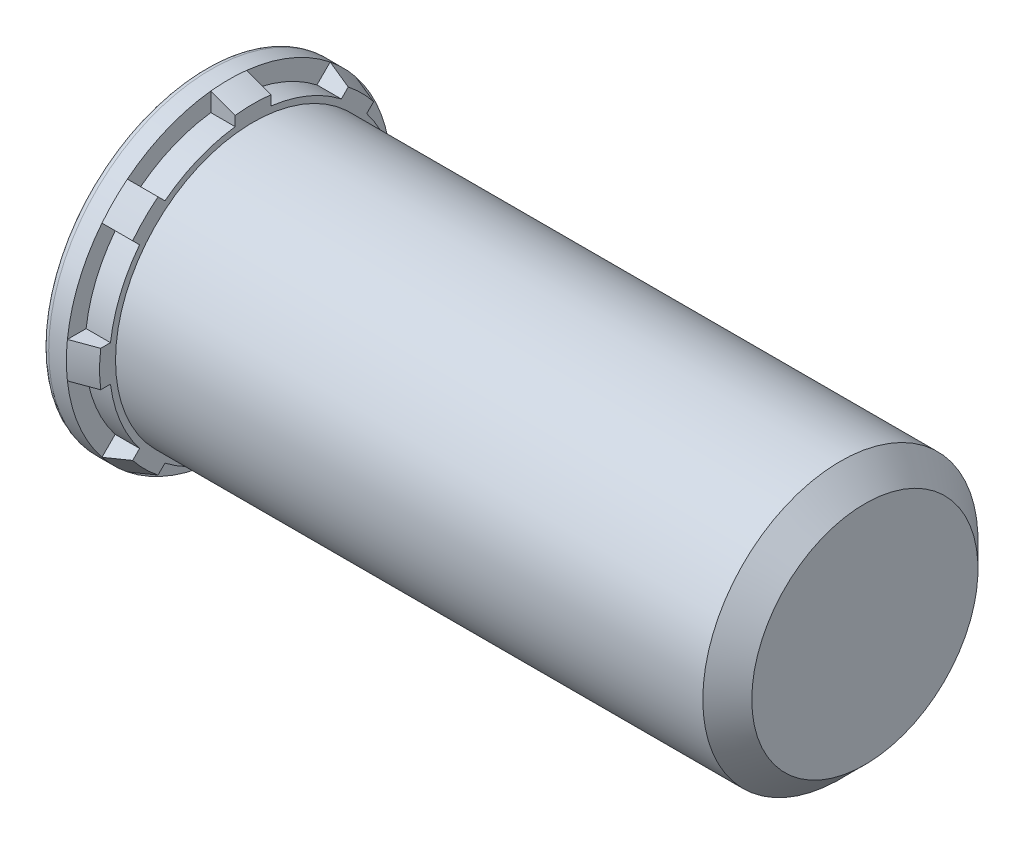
ISO-10303-21;
HEADER;
FILE_DESCRIPTION(('STEP AP214'),'2;1');
FILE_NAME('part.step','',(''),(''),'','','');
FILE_SCHEMA(('AUTOMOTIVE_DESIGN { 1 0 10303 214 1 1 1 1 }'));
ENDSEC;
DATA;
#1=APPLICATION_CONTEXT('core data for automotive mechanical design processes');
#2=APPLICATION_PROTOCOL_DEFINITION('international standard','automotive_design',2000,#1);
#3=PRODUCT_CONTEXT('',#1,'mechanical');
#4=PRODUCT('Part','Part','',(#3));
#5=PRODUCT_RELATED_PRODUCT_CATEGORY('part','',(#4));
#6=PRODUCT_DEFINITION_FORMATION('','',#4);
#7=PRODUCT_DEFINITION_CONTEXT('part definition',#1,'design');
#8=PRODUCT_DEFINITION('design','',#6,#7);
#9=PRODUCT_DEFINITION_SHAPE('','',#8);
#10=(LENGTH_UNIT() NAMED_UNIT(*) SI_UNIT(.MILLI.,.METRE.));
#11=(NAMED_UNIT(*) PLANE_ANGLE_UNIT() SI_UNIT($,.RADIAN.));
#12=(NAMED_UNIT(*) SI_UNIT($,.STERADIAN.) SOLID_ANGLE_UNIT());
#13=UNCERTAINTY_MEASURE_WITH_UNIT(LENGTH_MEASURE(1.E-05),#10,'distance_accuracy_value','');
#14=(GEOMETRIC_REPRESENTATION_CONTEXT(3) GLOBAL_UNCERTAINTY_ASSIGNED_CONTEXT((#13)) GLOBAL_UNIT_ASSIGNED_CONTEXT((#10,
#11,#12)) REPRESENTATION_CONTEXT('',''));
#15=CARTESIAN_POINT('',(0.,0.,0.));
#16=DIRECTION('',(0.,0.,1.));
#17=DIRECTION('',(1.,0.,0.));
#18=AXIS2_PLACEMENT_3D('',#15,#16,#17);
#19=CARTESIAN_POINT('',(0.,0.,0.));
#20=DIRECTION('',(-1.,0.,0.));
#21=DIRECTION('',(0.,0.,1.));
#22=AXIS2_PLACEMENT_3D('',#19,#20,#21);
#23=CONICAL_SURFACE('',#22,2.95,0.349065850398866);
#24=CARTESIAN_POINT('',(0.442699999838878,1.72774373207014,2.18922351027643));
#25=CARTESIAN_POINT('',(0.368886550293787,1.74687197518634,2.20835175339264));
#26=CARTESIAN_POINT('',(0.295071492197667,1.76599711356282,2.22747689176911));
#27=CARTESIAN_POINT('',(0.14743815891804,1.8042411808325,2.2657209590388));
#28=CARTESIAN_POINT('',(0.0736198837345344,1.82336010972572,2.28483988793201));
#29=CARTESIAN_POINT('',(-0.000199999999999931,1.8424759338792,2.30395571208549));
#30=B_SPLINE_CURVE_WITH_KNOTS('',3,(#24,#25,#26,#27,#28,#29),.UNSPECIFIED.,.F.,.F.,(4,2,4),(0.,
0.235842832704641,0.471685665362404),.UNSPECIFIED.);
#31=CARTESIAN_POINT('',(0.442499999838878,1.72779556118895,2.18927533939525));
#32=VERTEX_POINT('',#31);
#33=CARTESIAN_POINT('',(0.,1.84242414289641,2.30390392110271));
#34=VERTEX_POINT('',#33);
#35=EDGE_CURVE('E280',#32,#34,#30,.T.);
#36=ORIENTED_EDGE('',*,*,#35,.F.);
#37=CARTESIAN_POINT('',(0.4425,0.,0.));
#38=DIRECTION('',(-1.,0.,0.));
#39=DIRECTION('',(0.,0.,1.));
#40=AXIS2_PLACEMENT_3D('',#37,#38,#39);
#41=CIRCLE('',#40,2.78894317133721);
#42=CARTESIAN_POINT('',(0.442499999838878,2.18927533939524,1.72779556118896));
#43=VERTEX_POINT('',#42);
#44=EDGE_CURVE('E326',#32,#43,#41,.T.);
#45=ORIENTED_EDGE('',*,*,#44,.T.);
#46=CARTESIAN_POINT('',(-0.000200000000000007,2.30395571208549,1.84247593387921));
#47=CARTESIAN_POINT('',(0.0736198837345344,2.284839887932,1.82336010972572));
#48=CARTESIAN_POINT('',(0.14743815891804,2.26572095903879,1.80424118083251));
#49=CARTESIAN_POINT('',(0.295071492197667,2.22747689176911,1.76599711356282));
#50=CARTESIAN_POINT('',(0.368886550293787,2.20835175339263,1.74687197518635));
#51=CARTESIAN_POINT('',(0.442699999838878,2.18922351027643,1.72774373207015));
#52=B_SPLINE_CURVE_WITH_KNOTS('',3,(#46,#47,#48,#49,#50,#51),.UNSPECIFIED.,.F.,.F.,(4,2,4),(0.,
0.235842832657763,0.471685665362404),.UNSPECIFIED.);
#53=CARTESIAN_POINT('',(-1.61121658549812E-10,2.3039039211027,1.84242414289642));
#54=VERTEX_POINT('',#53);
#55=EDGE_CURVE('E505',#54,#43,#52,.T.);
#56=ORIENTED_EDGE('',*,*,#55,.F.);
#57=CARTESIAN_POINT('',(0.,0.,0.));
#58=DIRECTION('',(-1.,0.,0.));
#59=DIRECTION('',(0.,0.,1.));
#60=AXIS2_PLACEMENT_3D('',#57,#58,#59);
#61=CIRCLE('',#60,2.95);
#62=EDGE_CURVE('E287',#34,#54,#61,.T.);
#63=ORIENTED_EDGE('',*,*,#62,.F.);
#64=EDGE_LOOP('',(#36,#45,#56,#63));
#65=FACE_BOUND('',#64,.T.);
#66=ADVANCED_FACE('F39',(#65),#23,.T.);
#67=CARTESIAN_POINT('',(-0.915794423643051,0.326315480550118,3.2670661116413));
#68=CARTESIAN_POINT('',(-0.585094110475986,0.326315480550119,3.14612345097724));
#69=CARTESIAN_POINT('',(-0.254424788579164,0.326315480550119,3.02509618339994));
#70=CARTESIAN_POINT('',(0.406851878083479,0.32631548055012,2.78287243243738));
#71=CARTESIAN_POINT('',(0.737459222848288,0.32631548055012,2.66167594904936));
#72=CARTESIAN_POINT('',(1.06803557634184,0.326315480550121,2.54039485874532));
#73=B_SPLINE_CURVE_WITH_KNOTS('',3,(#67,#68,#69,#70,#71,#72),.UNSPECIFIED.,.F.,.F.,(4,2,4),(0.,
1.05636556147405,2.11273114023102),.UNSPECIFIED.);
#74=CARTESIAN_POINT('',(-1.61121658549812E-10,0.326315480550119,2.93189669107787));
#75=VERTEX_POINT('',#74);
#76=CARTESIAN_POINT('',(0.442499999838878,0.32631548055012,2.76978739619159));
#77=VERTEX_POINT('',#76);
#78=EDGE_CURVE('E251',#75,#77,#73,.T.);
#79=ORIENTED_EDGE('',*,*,#78,.F.);
#80=CARTESIAN_POINT('',(0.,-0.32631548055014,2.93189669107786));
#81=VERTEX_POINT('',#80);
#82=EDGE_CURVE('E271',#81,#75,#61,.T.);
#83=ORIENTED_EDGE('',*,*,#82,.F.);
#84=CARTESIAN_POINT('',(1.06803557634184,-0.326315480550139,2.54039485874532));
#85=CARTESIAN_POINT('',(0.737459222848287,-0.326315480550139,2.66167594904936));
#86=CARTESIAN_POINT('',(0.406851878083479,-0.326315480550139,2.78287243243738));
#87=CARTESIAN_POINT('',(-0.254424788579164,-0.32631548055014,3.02509618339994));
#88=CARTESIAN_POINT('',(-0.585094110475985,-0.326315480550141,3.14612345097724));
#89=CARTESIAN_POINT('',(-0.91579442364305,-0.326315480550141,3.2670661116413));
#90=B_SPLINE_CURVE_WITH_KNOTS('',3,(#84,#85,#86,#87,#88,#89),.UNSPECIFIED.,.F.,.F.,(4,2,4),(0.,
1.05636557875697,2.11273114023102),.UNSPECIFIED.);
#91=CARTESIAN_POINT('',(0.442499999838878,-0.326315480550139,2.76978739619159));
#92=VERTEX_POINT('',#91);
#93=EDGE_CURVE('E277',#92,#81,#90,.T.);
#94=ORIENTED_EDGE('',*,*,#93,.F.);
#95=EDGE_CURVE('E276',#92,#77,#41,.T.);
#96=ORIENTED_EDGE('',*,*,#95,.T.);
#97=EDGE_LOOP('',(#79,#83,#94,#96));
#98=FACE_BOUND('',#97,.T.);
#99=ADVANCED_FACE('F272',(#98),#23,.T.);
#100=CARTESIAN_POINT('',(-0.000200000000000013,-1.84247593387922,2.30395571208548));
#101=CARTESIAN_POINT('',(0.0736198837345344,-1.82336010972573,2.284839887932));
#102=CARTESIAN_POINT('',(0.14743815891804,-1.80424118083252,2.26572095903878));
#103=CARTESIAN_POINT('',(0.295071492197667,-1.76599711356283,2.2274768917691));
#104=CARTESIAN_POINT('',(0.368886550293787,-1.74687197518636,2.20835175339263));
#105=CARTESIAN_POINT('',(0.442699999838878,-1.72774373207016,2.18922351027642));
#106=B_SPLINE_CURVE_WITH_KNOTS('',3,(#100,#101,#102,#103,#104,#105),.UNSPECIFIED.,.F.,.F.,(4,2,
4),(0.,0.235842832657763,0.471685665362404),.UNSPECIFIED.);
#107=CARTESIAN_POINT('',(-1.61121658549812E-10,-1.84242414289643,2.30390392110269));
#108=VERTEX_POINT('',#107);
#109=CARTESIAN_POINT('',(0.442499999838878,-1.72779556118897,2.18927533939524));
#110=VERTEX_POINT('',#109);
#111=EDGE_CURVE('E348',#108,#110,#106,.T.);
#112=ORIENTED_EDGE('',*,*,#111,.F.);
#113=CARTESIAN_POINT('',(0.,-2.30390392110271,1.8424241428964));
#114=VERTEX_POINT('',#113);
#115=EDGE_CURVE('E284',#114,#108,#61,.T.);
#116=ORIENTED_EDGE('',*,*,#115,.F.);
#117=CARTESIAN_POINT('',(0.442699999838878,-2.18922351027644,1.72774373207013));
#118=CARTESIAN_POINT('',(0.368886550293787,-2.20835175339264,1.74687197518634));
#119=CARTESIAN_POINT('',(0.295071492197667,-2.22747689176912,1.76599711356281));
#120=CARTESIAN_POINT('',(0.14743815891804,-2.2657209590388,1.80424118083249));
#121=CARTESIAN_POINT('',(0.0736198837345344,-2.28483988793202,1.82336010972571));
#122=CARTESIAN_POINT('',(-0.000199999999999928,-2.3039557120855,1.84247593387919));
#123=B_SPLINE_CURVE_WITH_KNOTS('',3,(#117,#118,#119,#120,#121,#122),.UNSPECIFIED.,.F.,.F.,(4,2,
4),(0.,0.235842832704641,0.471685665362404),.UNSPECIFIED.);
#124=CARTESIAN_POINT('',(0.442499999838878,-2.18927533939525,1.72779556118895));
#125=VERTEX_POINT('',#124);
#126=EDGE_CURVE('E616',#125,#114,#123,.T.);
#127=ORIENTED_EDGE('',*,*,#126,.F.);
#128=EDGE_CURVE('E594',#125,#110,#41,.T.);
#129=ORIENTED_EDGE('',*,*,#128,.T.);
#130=EDGE_LOOP('',(#112,#116,#127,#129));
#131=FACE_BOUND('',#130,.T.);
#132=ADVANCED_FACE('F578',(#131),#23,.T.);
#133=CARTESIAN_POINT('',(-0.915794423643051,-3.2670661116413,0.326315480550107));
#134=CARTESIAN_POINT('',(-0.585094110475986,-3.14612345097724,0.326315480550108));
#135=CARTESIAN_POINT('',(-0.254424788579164,-3.02509618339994,0.326315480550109));
#136=CARTESIAN_POINT('',(0.406851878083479,-2.78287243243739,0.32631548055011));
#137=CARTESIAN_POINT('',(0.737459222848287,-2.66167594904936,0.326315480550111));
#138=CARTESIAN_POINT('',(1.06803557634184,-2.54039485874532,0.326315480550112));
#139=B_SPLINE_CURVE_WITH_KNOTS('',3,(#133,#134,#135,#136,#137,#138),.UNSPECIFIED.,.F.,.F.,(4,2,
4),(0.,1.05636556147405,2.11273114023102),.UNSPECIFIED.);
#140=CARTESIAN_POINT('',(-1.61121658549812E-10,-2.93189669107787,0.326315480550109));
#141=VERTEX_POINT('',#140);
#142=CARTESIAN_POINT('',(0.442499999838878,-2.76978739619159,0.32631548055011));
#143=VERTEX_POINT('',#142);
#144=EDGE_CURVE('E629',#141,#143,#139,.T.);
#145=ORIENTED_EDGE('',*,*,#144,.F.);
#146=CARTESIAN_POINT('',(0.,-2.93189669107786,-0.32631548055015));
#147=VERTEX_POINT('',#146);
#148=EDGE_CURVE('E290',#147,#141,#61,.T.);
#149=ORIENTED_EDGE('',*,*,#148,.F.);
#150=CARTESIAN_POINT('',(1.06803557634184,-2.54039485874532,-0.326315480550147));
#151=CARTESIAN_POINT('',(0.737459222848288,-2.66167594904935,-0.326315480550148));
#152=CARTESIAN_POINT('',(0.406851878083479,-2.78287243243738,-0.326315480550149));
#153=CARTESIAN_POINT('',(-0.254424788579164,-3.02509618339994,-0.326315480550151));
#154=CARTESIAN_POINT('',(-0.585094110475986,-3.14612345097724,-0.326315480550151));
#155=CARTESIAN_POINT('',(-0.915794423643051,-3.2670661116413,-0.326315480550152));
#156=B_SPLINE_CURVE_WITH_KNOTS('',3,(#150,#151,#152,#153,#154,#155),.UNSPECIFIED.,.F.,.F.,(4,2,
4),(0.,1.05636557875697,2.11273114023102),.UNSPECIFIED.);
#157=CARTESIAN_POINT('',(0.442499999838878,-2.76978739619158,-0.326315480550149));
#158=VERTEX_POINT('',#157);
#159=EDGE_CURVE('E637',#158,#147,#156,.T.);
#160=ORIENTED_EDGE('',*,*,#159,.F.);
#161=EDGE_CURVE('E603',#158,#143,#41,.T.);
#162=ORIENTED_EDGE('',*,*,#161,.T.);
#163=EDGE_LOOP('',(#145,#149,#160,#162));
#164=FACE_BOUND('',#163,.T.);
#165=ADVANCED_FACE('F639',(#164),#23,.T.);
#166=CARTESIAN_POINT('',(-0.000200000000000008,-2.30395571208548,-1.84247593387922));
#167=CARTESIAN_POINT('',(0.0736198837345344,-2.28483988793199,-1.82336010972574));
#168=CARTESIAN_POINT('',(0.14743815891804,-2.26572095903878,-1.80424118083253));
#169=CARTESIAN_POINT('',(0.295071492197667,-2.22747689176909,-1.76599711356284));
#170=CARTESIAN_POINT('',(0.368886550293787,-2.20835175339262,-1.74687197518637));
#171=CARTESIAN_POINT('',(0.442699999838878,-2.18922351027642,-1.72774373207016));
#172=B_SPLINE_CURVE_WITH_KNOTS('',3,(#166,#167,#168,#169,#170,#171),.UNSPECIFIED.,.F.,.F.,(4,2,
4),(0.,0.235842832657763,0.471685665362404),.UNSPECIFIED.);
#173=CARTESIAN_POINT('',(-1.61121658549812E-10,-2.30390392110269,-1.84242414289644));
#174=VERTEX_POINT('',#173);
#175=CARTESIAN_POINT('',(0.442499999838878,-2.18927533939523,-1.72779556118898));
#176=VERTEX_POINT('',#175);
#177=EDGE_CURVE('E644',#174,#176,#172,.T.);
#178=ORIENTED_EDGE('',*,*,#177,.F.);
#179=CARTESIAN_POINT('',(0.,-1.8424241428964,-2.30390392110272));
#180=VERTEX_POINT('',#179);
#181=EDGE_CURVE('E724',#180,#174,#61,.T.);
#182=ORIENTED_EDGE('',*,*,#181,.F.);
#183=CARTESIAN_POINT('',(0.442699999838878,-1.72774373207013,-2.18922351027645));
#184=CARTESIAN_POINT('',(0.368886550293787,-1.74687197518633,-2.20835175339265));
#185=CARTESIAN_POINT('',(0.295071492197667,-1.7659971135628,-2.22747689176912));
#186=CARTESIAN_POINT('',(0.14743815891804,-1.80424118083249,-2.26572095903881));
#187=CARTESIAN_POINT('',(0.0736198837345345,-1.8233601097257,-2.28483988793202));
#188=CARTESIAN_POINT('',(-0.000199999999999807,-1.84247593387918,-2.30395571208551));
#189=B_SPLINE_CURVE_WITH_KNOTS('',3,(#183,#184,#185,#186,#187,#188),.UNSPECIFIED.,.F.,.F.,(4,2,
4),(0.,0.23584283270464,0.471685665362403),.UNSPECIFIED.);
#190=CARTESIAN_POINT('',(0.442499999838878,-1.72779556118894,-2.18927533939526));
#191=VERTEX_POINT('',#190);
#192=EDGE_CURVE('E646',#191,#180,#189,.T.);
#193=ORIENTED_EDGE('',*,*,#192,.F.);
#194=EDGE_CURVE('E596',#191,#176,#41,.T.);
#195=ORIENTED_EDGE('',*,*,#194,.T.);
#196=EDGE_LOOP('',(#178,#182,#193,#195));
#197=FACE_BOUND('',#196,.T.);
#198=ADVANCED_FACE('F893',(#197),#23,.T.);
#199=CARTESIAN_POINT('',(-0.91579442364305,-0.326315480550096,-3.26706611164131));
#200=CARTESIAN_POINT('',(-0.585094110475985,-0.326315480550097,-3.14612345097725));
#201=CARTESIAN_POINT('',(-0.254424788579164,-0.326315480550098,-3.02509618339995));
#202=CARTESIAN_POINT('',(0.406851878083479,-0.326315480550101,-2.78287243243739));
#203=CARTESIAN_POINT('',(0.737459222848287,-0.326315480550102,-2.66167594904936));
#204=CARTESIAN_POINT('',(1.06803557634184,-0.326315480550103,-2.54039485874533));
#205=B_SPLINE_CURVE_WITH_KNOTS('',3,(#199,#200,#201,#202,#203,#204),.UNSPECIFIED.,.F.,.F.,(4,2,
4),(0.,1.05636556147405,2.11273114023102),.UNSPECIFIED.);
#206=CARTESIAN_POINT('',(-1.61121658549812E-10,-0.326315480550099,-2.93189669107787));
#207=VERTEX_POINT('',#206);
#208=CARTESIAN_POINT('',(0.442499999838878,-0.326315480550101,-2.76978739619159));
#209=VERTEX_POINT('',#208);
#210=EDGE_CURVE('E694',#207,#209,#205,.T.);
#211=ORIENTED_EDGE('',*,*,#210,.F.);
#212=CARTESIAN_POINT('',(0.,0.32631548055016,-2.93189669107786));
#213=VERTEX_POINT('',#212);
#214=EDGE_CURVE('E716',#213,#207,#61,.T.);
#215=ORIENTED_EDGE('',*,*,#214,.F.);
#216=CARTESIAN_POINT('',(1.06803557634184,0.326315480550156,-2.54039485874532));
#217=CARTESIAN_POINT('',(0.737459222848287,0.326315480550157,-2.66167594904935));
#218=CARTESIAN_POINT('',(0.406851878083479,0.326315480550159,-2.78287243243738));
#219=CARTESIAN_POINT('',(-0.254424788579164,0.326315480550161,-3.02509618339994));
#220=CARTESIAN_POINT('',(-0.585094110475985,0.326315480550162,-3.14612345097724));
#221=CARTESIAN_POINT('',(-0.91579442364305,0.326315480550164,-3.2670661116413));
#222=B_SPLINE_CURVE_WITH_KNOTS('',3,(#216,#217,#218,#219,#220,#221),.UNSPECIFIED.,.F.,.F.,(4,2,
4),(0.,1.05636557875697,2.11273114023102),.UNSPECIFIED.);
#223=CARTESIAN_POINT('',(0.442499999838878,0.326315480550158,-2.76978739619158));
#224=VERTEX_POINT('',#223);
#225=EDGE_CURVE('E464',#224,#213,#222,.T.);
#226=ORIENTED_EDGE('',*,*,#225,.F.);
#227=EDGE_CURVE('E330',#224,#209,#41,.T.);
#228=ORIENTED_EDGE('',*,*,#227,.T.);
#229=EDGE_LOOP('',(#211,#215,#226,#228));
#230=FACE_BOUND('',#229,.T.);
#231=ADVANCED_FACE('F719',(#230),#23,.T.);
#232=CARTESIAN_POINT('',(1.06803557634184,2.54039485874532,0.326315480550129));
#233=CARTESIAN_POINT('',(0.737459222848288,2.66167594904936,0.326315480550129));
#234=CARTESIAN_POINT('',(0.406851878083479,2.78287243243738,0.326315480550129));
#235=CARTESIAN_POINT('',(-0.254424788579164,3.02509618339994,0.326315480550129));
#236=CARTESIAN_POINT('',(-0.585094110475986,3.14612345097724,0.326315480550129));
#237=CARTESIAN_POINT('',(-0.915794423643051,3.2670661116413,0.326315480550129));
#238=B_SPLINE_CURVE_WITH_KNOTS('',3,(#232,#233,#234,#235,#236,#237),.UNSPECIFIED.,.F.,.F.,(4,2,
4),(0.,1.05636557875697,2.11273114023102),.UNSPECIFIED.);
#239=CARTESIAN_POINT('',(0.442499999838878,2.76978739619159,0.326315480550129));
#240=VERTEX_POINT('',#239);
#241=CARTESIAN_POINT('',(0.,2.93189669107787,0.326315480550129));
#242=VERTEX_POINT('',#241);
#243=EDGE_CURVE('E491',#240,#242,#238,.T.);
#244=ORIENTED_EDGE('',*,*,#243,.F.);
#245=CARTESIAN_POINT('',(0.442499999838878,2.76978739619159,-0.32631548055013));
#246=VERTEX_POINT('',#245);
#247=EDGE_CURVE('E325',#240,#246,#41,.T.);
#248=ORIENTED_EDGE('',*,*,#247,.T.);
#249=CARTESIAN_POINT('',(-0.91579442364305,3.2670661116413,-0.32631548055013));
#250=CARTESIAN_POINT('',(-0.585094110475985,3.14612345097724,-0.32631548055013));
#251=CARTESIAN_POINT('',(-0.254424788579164,3.02509618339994,-0.32631548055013));
#252=CARTESIAN_POINT('',(0.406851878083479,2.78287243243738,-0.32631548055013));
#253=CARTESIAN_POINT('',(0.737459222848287,2.66167594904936,-0.32631548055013));
#254=CARTESIAN_POINT('',(1.06803557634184,2.54039485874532,-0.32631548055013));
#255=B_SPLINE_CURVE_WITH_KNOTS('',3,(#249,#250,#251,#252,#253,#254),.UNSPECIFIED.,.F.,.F.,(4,2,
4),(0.,1.05636556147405,2.11273114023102),.UNSPECIFIED.);
#256=CARTESIAN_POINT('',(-1.61121658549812E-10,2.93189669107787,-0.32631548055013));
#257=VERTEX_POINT('',#256);
#258=EDGE_CURVE('E521',#257,#246,#255,.T.);
#259=ORIENTED_EDGE('',*,*,#258,.F.);
#260=EDGE_CURVE('E286',#242,#257,#61,.T.);
#261=ORIENTED_EDGE('',*,*,#260,.F.);
#262=EDGE_LOOP('',(#244,#248,#259,#261));
#263=FACE_BOUND('',#262,.T.);
#264=ADVANCED_FACE('F575',(#263),#23,.T.);
#265=CARTESIAN_POINT('',(-0.000200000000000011,1.84247593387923,-2.30395571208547));
#266=CARTESIAN_POINT('',(0.0736198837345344,1.82336010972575,-2.28483988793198));
#267=CARTESIAN_POINT('',(0.14743815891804,1.80424118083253,-2.26572095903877));
#268=CARTESIAN_POINT('',(0.295071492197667,1.76599711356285,-2.22747689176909));
#269=CARTESIAN_POINT('',(0.368886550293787,1.74687197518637,-2.20835175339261));
#270=CARTESIAN_POINT('',(0.442699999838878,1.72774373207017,-2.18922351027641));
#271=B_SPLINE_CURVE_WITH_KNOTS('',3,(#265,#266,#267,#268,#269,#270),.UNSPECIFIED.,.F.,.F.,(4,2,
4),(0.,0.235842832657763,0.471685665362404),.UNSPECIFIED.);
#272=CARTESIAN_POINT('',(-1.61121658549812E-10,1.84242414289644,-2.30390392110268));
#273=VERTEX_POINT('',#272);
#274=CARTESIAN_POINT('',(0.442499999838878,1.72779556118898,-2.18927533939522));
#275=VERTEX_POINT('',#274);
#276=EDGE_CURVE('E454',#273,#275,#271,.T.);
#277=ORIENTED_EDGE('',*,*,#276,.F.);
#278=CARTESIAN_POINT('',(0.,2.3039039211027,-1.84242414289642));
#279=VERTEX_POINT('',#278);
#280=EDGE_CURVE('E295',#279,#273,#61,.T.);
#281=ORIENTED_EDGE('',*,*,#280,.F.);
#282=CARTESIAN_POINT('',(0.442699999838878,2.18922351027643,-1.72774373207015));
#283=CARTESIAN_POINT('',(0.368886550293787,2.20835175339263,-1.74687197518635));
#284=CARTESIAN_POINT('',(0.295071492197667,2.22747689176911,-1.76599711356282));
#285=CARTESIAN_POINT('',(0.14743815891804,2.26572095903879,-1.80424118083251));
#286=CARTESIAN_POINT('',(0.0736198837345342,2.284839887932,-1.82336010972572));
#287=CARTESIAN_POINT('',(-0.000200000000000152,2.30395571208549,-1.84247593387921));
#288=B_SPLINE_CURVE_WITH_KNOTS('',3,(#282,#283,#284,#285,#286,#287),.UNSPECIFIED.,.F.,.F.,(4,2,
4),(0.,0.235842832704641,0.471685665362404),.UNSPECIFIED.);
#289=CARTESIAN_POINT('',(0.442499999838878,2.18927533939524,-1.72779556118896));
#290=VERTEX_POINT('',#289);
#291=EDGE_CURVE('E294',#290,#279,#288,.T.);
#292=ORIENTED_EDGE('',*,*,#291,.F.);
#293=EDGE_CURVE('E322',#290,#275,#41,.T.);
#294=ORIENTED_EDGE('',*,*,#293,.T.);
#295=EDGE_LOOP('',(#277,#281,#292,#294));
#296=FACE_BOUND('',#295,.T.);
#297=ADVANCED_FACE('F41',(#296),#23,.T.);
#298=CARTESIAN_POINT('',(0.4425,2.78894317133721,0.));
#299=DIRECTION('',(1.,0.,0.));
#300=DIRECTION('',(0.,0.,-1.));
#301=AXIS2_PLACEMENT_3D('',#298,#299,#300);
#302=PLANE('',#301);
#303=DIRECTION('',(0.,0.707106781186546,0.707106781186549));
#304=VECTOR('',#303,1.);
#305=CARTESIAN_POINT('',(0.442499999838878,1.60210959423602,2.06358937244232));
#306=LINE('',#305,#304);
#307=CARTESIAN_POINT('',(0.442499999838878,1.60210959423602,2.06358937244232));
#308=VERTEX_POINT('',#307);
#309=EDGE_CURVE('E267',#308,#32,#306,.T.);
#310=ORIENTED_EDGE('',*,*,#309,.F.);
#311=CARTESIAN_POINT('',(0.442499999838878,0.,0.));
#312=DIRECTION('',(-1.,0.,0.));
#313=DIRECTION('',(0.,1.,0.));
#314=AXIS2_PLACEMENT_3D('',#311,#312,#313);
#315=CIRCLE('',#314,2.6125);
#316=CARTESIAN_POINT('',(0.442499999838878,0.326315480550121,2.59204059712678));
#317=VERTEX_POINT('',#316);
#318=EDGE_CURVE('E375',#317,#308,#315,.T.);
#319=ORIENTED_EDGE('',*,*,#318,.F.);
#320=DIRECTION('',(0.,0.,-1.));
#321=VECTOR('',#320,1.);
#322=CARTESIAN_POINT('',(0.4425,0.32631548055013,0.));
#323=LINE('',#322,#321);
#324=EDGE_CURVE('E11',#77,#317,#323,.T.);
#325=ORIENTED_EDGE('',*,*,#324,.F.);
#326=ORIENTED_EDGE('',*,*,#95,.F.);
#327=DIRECTION('',(0.,0.,1.));
#328=VECTOR('',#327,1.);
#329=CARTESIAN_POINT('',(0.442499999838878,-0.326315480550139,2.59204059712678));
#330=LINE('',#329,#328);
#331=CARTESIAN_POINT('',(0.442499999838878,-0.326315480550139,2.59204059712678));
#332=VERTEX_POINT('',#331);
#333=EDGE_CURVE('E361',#332,#92,#330,.T.);
#334=ORIENTED_EDGE('',*,*,#333,.F.);
#335=CARTESIAN_POINT('',(0.442499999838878,0.,0.));
#336=DIRECTION('',(-1.,0.,0.));
#337=DIRECTION('',(0.,0.707106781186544,0.707106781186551));
#338=AXIS2_PLACEMENT_3D('',#335,#336,#337);
#339=CIRCLE('',#338,2.6125);
#340=CARTESIAN_POINT('',(0.442499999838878,-1.60210959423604,2.06358937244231));
#341=VERTEX_POINT('',#340);
#342=EDGE_CURVE('E351',#341,#332,#339,.T.);
#343=ORIENTED_EDGE('',*,*,#342,.F.);
#344=DIRECTION('',(0.,0.707106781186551,-0.707106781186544));
#345=VECTOR('',#344,1.);
#346=CARTESIAN_POINT('',(0.4425,1.62521147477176,-1.16373169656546));
#347=LINE('',#346,#345);
#348=EDGE_CURVE('E48',#110,#341,#347,.T.);
#349=ORIENTED_EDGE('',*,*,#348,.F.);
#350=ORIENTED_EDGE('',*,*,#128,.F.);
#351=DIRECTION('',(0.,-0.707106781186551,0.707106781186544));
#352=VECTOR('',#351,1.);
#353=CARTESIAN_POINT('',(0.442499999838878,-2.06358937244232,1.60210959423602));
#354=LINE('',#353,#352);
#355=CARTESIAN_POINT('',(0.442499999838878,-2.06358937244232,1.60210959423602));
#356=VERTEX_POINT('',#355);
#357=EDGE_CURVE('E377',#356,#125,#354,.T.);
#358=ORIENTED_EDGE('',*,*,#357,.F.);
#359=CARTESIAN_POINT('',(0.442499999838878,0.,0.));
#360=DIRECTION('',(-1.,0.,0.));
#361=DIRECTION('',(0.,0.,1.));
#362=AXIS2_PLACEMENT_3D('',#359,#360,#361);
#363=CIRCLE('',#362,2.6125);
#364=CARTESIAN_POINT('',(0.442499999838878,-2.59204059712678,0.326315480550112));
#365=VERTEX_POINT('',#364);
#366=EDGE_CURVE('E386',#365,#356,#363,.T.);
#367=ORIENTED_EDGE('',*,*,#366,.F.);
#368=DIRECTION('',(0.,1.,0.));
#369=VECTOR('',#368,1.);
#370=CARTESIAN_POINT('',(0.4425,2.7889431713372,0.326315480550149));
#371=LINE('',#370,#369);
#372=EDGE_CURVE('E336',#143,#365,#371,.T.);
#373=ORIENTED_EDGE('',*,*,#372,.F.);
#374=ORIENTED_EDGE('',*,*,#161,.F.);
#375=DIRECTION('',(0.,-1.,0.));
#376=VECTOR('',#375,1.);
#377=CARTESIAN_POINT('',(0.442499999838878,-2.59204059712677,-0.326315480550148));
#378=LINE('',#377,#376);
#379=CARTESIAN_POINT('',(0.442499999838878,-2.59204059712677,-0.326315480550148));
#380=VERTEX_POINT('',#379);
#381=EDGE_CURVE('E399',#380,#158,#378,.T.);
#382=ORIENTED_EDGE('',*,*,#381,.F.);
#383=CARTESIAN_POINT('',(0.442499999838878,0.,0.));
#384=DIRECTION('',(-1.,0.,0.));
#385=DIRECTION('',(0.,-0.707106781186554,0.707106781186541));
#386=AXIS2_PLACEMENT_3D('',#383,#384,#385);
#387=CIRCLE('',#386,2.6125);
#388=CARTESIAN_POINT('',(0.442499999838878,-2.0635893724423,-1.60210959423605));
#389=VERTEX_POINT('',#388);
#390=EDGE_CURVE('E406',#389,#380,#387,.T.);
#391=ORIENTED_EDGE('',*,*,#390,.F.);
#392=DIRECTION('',(0.,0.707106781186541,0.707106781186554));
#393=VECTOR('',#392,1.);
#394=CARTESIAN_POINT('',(0.4425,1.16373169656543,1.62521147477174));
#395=LINE('',#394,#393);
#396=EDGE_CURVE('E337',#176,#389,#395,.T.);
#397=ORIENTED_EDGE('',*,*,#396,.F.);
#398=ORIENTED_EDGE('',*,*,#194,.F.);
#399=DIRECTION('',(0.,-0.707106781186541,-0.707106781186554));
#400=VECTOR('',#399,1.);
#401=CARTESIAN_POINT('',(0.442499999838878,-1.60210959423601,-2.06358937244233));
#402=LINE('',#401,#400);
#403=CARTESIAN_POINT('',(0.442499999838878,-1.60210959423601,-2.06358937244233));
#404=VERTEX_POINT('',#403);
#405=EDGE_CURVE('E420',#404,#191,#402,.T.);
#406=ORIENTED_EDGE('',*,*,#405,.F.);
#407=CARTESIAN_POINT('',(0.442499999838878,0.,0.));
#408=DIRECTION('',(-1.,0.,0.));
#409=DIRECTION('',(0.,-1.,0.));
#410=AXIS2_PLACEMENT_3D('',#407,#408,#409);
#411=CIRCLE('',#410,2.6125);
#412=CARTESIAN_POINT('',(0.442499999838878,-0.326315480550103,-2.59204059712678));
#413=VERTEX_POINT('',#412);
#414=EDGE_CURVE('E430',#413,#404,#411,.T.);
#415=ORIENTED_EDGE('',*,*,#414,.F.);
#416=DIRECTION('',(0.,0.,1.));
#417=VECTOR('',#416,1.);
#418=CARTESIAN_POINT('',(0.4425,-0.32631548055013,0.));
#419=LINE('',#418,#417);
#420=EDGE_CURVE('E331',#209,#413,#419,.T.);
#421=ORIENTED_EDGE('',*,*,#420,.F.);
#422=ORIENTED_EDGE('',*,*,#227,.F.);
#423=DIRECTION('',(0.,0.,-1.));
#424=VECTOR('',#423,1.);
#425=CARTESIAN_POINT('',(0.442499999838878,0.326315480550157,-2.59204059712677));
#426=LINE('',#425,#424);
#427=CARTESIAN_POINT('',(0.442499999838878,0.326315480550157,-2.59204059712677));
#428=VERTEX_POINT('',#427);
#429=EDGE_CURVE('E437',#428,#224,#426,.T.);
#430=ORIENTED_EDGE('',*,*,#429,.F.);
#431=CARTESIAN_POINT('',(0.442499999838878,0.,0.));
#432=DIRECTION('',(-1.,0.,0.));
#433=DIRECTION('',(0.,-0.707106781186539,-0.707106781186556));
#434=AXIS2_PLACEMENT_3D('',#431,#432,#433);
#435=CIRCLE('',#434,2.6125);
#436=CARTESIAN_POINT('',(0.442499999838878,1.60210959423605,-2.0635893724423));
#437=VERTEX_POINT('',#436);
#438=EDGE_CURVE('E449',#437,#428,#435,.T.);
#439=ORIENTED_EDGE('',*,*,#438,.F.);
#440=DIRECTION('',(0.,-0.707106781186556,0.707106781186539));
#441=VECTOR('',#440,1.);
#442=CARTESIAN_POINT('',(0.4425,1.1637316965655,-1.62521147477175));
#443=LINE('',#442,#441);
#444=EDGE_CURVE('E334',#275,#437,#443,.T.);
#445=ORIENTED_EDGE('',*,*,#444,.F.);
#446=ORIENTED_EDGE('',*,*,#293,.F.);
#447=DIRECTION('',(0.,0.707106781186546,-0.707106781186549));
#448=VECTOR('',#447,1.);
#449=CARTESIAN_POINT('',(0.442499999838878,2.06358937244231,-1.60210959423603));
#450=LINE('',#449,#448);
#451=CARTESIAN_POINT('',(0.442499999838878,2.06358937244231,-1.60210959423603));
#452=VERTEX_POINT('',#451);
#453=EDGE_CURVE('E515',#452,#290,#450,.T.);
#454=ORIENTED_EDGE('',*,*,#453,.F.);
#455=CARTESIAN_POINT('',(0.442499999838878,0.,0.));
#456=DIRECTION('',(-1.,0.,0.));
#457=DIRECTION('',(0.,0.,-1.));
#458=AXIS2_PLACEMENT_3D('',#455,#456,#457);
#459=CIRCLE('',#458,2.6125);
#460=CARTESIAN_POINT('',(0.442499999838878,2.59204059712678,-0.32631548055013));
#461=VERTEX_POINT('',#460);
#462=EDGE_CURVE('E501',#461,#452,#459,.T.);
#463=ORIENTED_EDGE('',*,*,#462,.F.);
#464=DIRECTION('',(0.,-1.,0.));
#465=VECTOR('',#464,1.);
#466=CARTESIAN_POINT('',(0.4425,2.78894317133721,-0.32631548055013));
#467=LINE('',#466,#465);
#468=EDGE_CURVE('E328',#246,#461,#467,.T.);
#469=ORIENTED_EDGE('',*,*,#468,.F.);
#470=ORIENTED_EDGE('',*,*,#247,.F.);
#471=DIRECTION('',(0.,1.,0.));
#472=VECTOR('',#471,1.);
#473=CARTESIAN_POINT('',(0.442499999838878,2.59204059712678,0.326315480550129));
#474=LINE('',#473,#472);
#475=CARTESIAN_POINT('',(0.442499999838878,2.59204059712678,0.32631548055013));
#476=VERTEX_POINT('',#475);
#477=EDGE_CURVE('E825',#476,#240,#474,.T.);
#478=ORIENTED_EDGE('',*,*,#477,.F.);
#479=CARTESIAN_POINT('',(0.442499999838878,0.,0.));
#480=DIRECTION('',(-1.,0.,0.));
#481=DIRECTION('',(0.,0.707106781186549,-0.707106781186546));
#482=AXIS2_PLACEMENT_3D('',#479,#480,#481);
#483=CIRCLE('',#482,2.6125);
#484=CARTESIAN_POINT('',(0.442499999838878,2.06358937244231,1.60210959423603));
#485=VERTEX_POINT('',#484);
#486=EDGE_CURVE('E590',#485,#476,#483,.T.);
#487=ORIENTED_EDGE('',*,*,#486,.F.);
#488=DIRECTION('',(0.,-0.707106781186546,-0.707106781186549));
#489=VECTOR('',#488,1.);
#490=CARTESIAN_POINT('',(0.4425,1.62521147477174,1.16373169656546));
#491=LINE('',#490,#489);
#492=EDGE_CURVE('E329',#43,#485,#491,.T.);
#493=ORIENTED_EDGE('',*,*,#492,.F.);
#494=ORIENTED_EDGE('',*,*,#44,.F.);
#495=EDGE_LOOP('',(#310,#319,#325,#326,#334,#343,#349,#350,#358,#367,#373,#374,#382,#391,#397,
#398,#406,#415,#421,#422,#430,#439,#445,#446,#454,#463,#469,#470,#478,#487,#493,#494));
#496=FACE_BOUND('',#495,.T.);
#497=CARTESIAN_POINT('',(0.4425,0.,0.));
#498=DIRECTION('',(-1.,0.,0.));
#499=DIRECTION('',(0.,0.,1.));
#500=AXIS2_PLACEMENT_3D('',#497,#498,#499);
#501=CIRCLE('',#500,2.5);
#502=CARTESIAN_POINT('',(0.4425,0.,2.5));
#503=VERTEX_POINT('',#502);
#504=EDGE_CURVE('E316',#503,#503,#501,.T.);
#505=ORIENTED_EDGE('',*,*,#504,.T.);
#506=EDGE_LOOP('',(#505));
#507=FACE_BOUND('',#506,.T.);
#508=ADVANCED_FACE('F363',(#496,#507),#302,.T.);
#509=CARTESIAN_POINT('',(0.,0.,0.));
#510=DIRECTION('',(-1.,0.,0.));
#511=DIRECTION('',(0.,0.,1.));
#512=AXIS2_PLACEMENT_3D('',#509,#510,#511);
#513=CYLINDRICAL_SURFACE('',#512,2.5);
#514=CARTESIAN_POINT('',(11.1124999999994,0.,0.));
#515=DIRECTION('',(-1.,0.,0.));
#516=DIRECTION('',(0.,0.,1.));
#517=AXIS2_PLACEMENT_3D('',#514,#515,#516);
#518=CIRCLE('',#517,2.5);
#519=CARTESIAN_POINT('',(11.1124999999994,0.,2.5));
#520=VERTEX_POINT('',#519);
#521=EDGE_CURVE('E317',#520,#520,#518,.T.);
#522=ORIENTED_EDGE('',*,*,#521,.T.);
#523=EDGE_LOOP('',(#522));
#524=FACE_BOUND('',#523,.T.);
#525=ORIENTED_EDGE('',*,*,#504,.F.);
#526=EDGE_LOOP('',(#525));
#527=FACE_BOUND('',#526,.T.);
#528=ADVANCED_FACE('F562',(#524,#527),#513,.T.);
#529=CARTESIAN_POINT('',(11.5575,0.,0.));
#530=DIRECTION('',(-1.,0.,0.));
#531=DIRECTION('',(0.,0.,1.));
#532=AXIS2_PLACEMENT_3D('',#529,#530,#531);
#533=CONICAL_SURFACE('',#532,2.055,0.785398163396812);
#534=ORIENTED_EDGE('',*,*,#521,.F.);
#535=EDGE_LOOP('',(#534));
#536=FACE_BOUND('',#535,.T.);
#537=CARTESIAN_POINT('',(11.5575,0.,0.));
#538=DIRECTION('',(-1.,0.,0.));
#539=DIRECTION('',(0.,0.,1.));
#540=AXIS2_PLACEMENT_3D('',#537,#538,#539);
#541=CIRCLE('',#540,2.055);
#542=CARTESIAN_POINT('',(11.5575,0.,2.055));
#543=VERTEX_POINT('',#542);
#544=EDGE_CURVE('E312',#543,#543,#541,.T.);
#545=ORIENTED_EDGE('',*,*,#544,.T.);
#546=EDGE_LOOP('',(#545));
#547=FACE_BOUND('',#546,.T.);
#548=ADVANCED_FACE('F557',(#536,#547),#533,.T.);
#549=CARTESIAN_POINT('',(11.5575,2.055,0.));
#550=DIRECTION('',(1.,0.,0.));
#551=DIRECTION('',(0.,0.,-1.));
#552=AXIS2_PLACEMENT_3D('',#549,#550,#551);
#553=PLANE('',#552);
#554=ORIENTED_EDGE('',*,*,#544,.F.);
#555=EDGE_LOOP('',(#554));
#556=FACE_BOUND('',#555,.T.);
#557=ADVANCED_FACE('F558',(#556),#553,.T.);
#558=CARTESIAN_POINT('',(-0.4425,2.82946,0.));
#559=DIRECTION('',(1.,0.,0.));
#560=DIRECTION('',(0.,0.,-1.));
#561=AXIS2_PLACEMENT_3D('',#558,#559,#560);
#562=PLANE('',#561);
#563=CARTESIAN_POINT('',(-0.4425,0.,0.));
#564=DIRECTION('',(-1.,0.,0.));
#565=DIRECTION('',(0.,0.,1.));
#566=AXIS2_PLACEMENT_3D('',#563,#564,#565);
#567=CIRCLE('',#566,2.82946);
#568=CARTESIAN_POINT('',(-0.4425,0.,2.82946));
#569=VERTEX_POINT('',#568);
#570=EDGE_CURVE('E309',#569,#569,#567,.T.);
#571=ORIENTED_EDGE('',*,*,#570,.T.);
#572=EDGE_LOOP('',(#571));
#573=FACE_BOUND('',#572,.T.);
#574=ADVANCED_FACE('F552',(#573),#562,.F.);
#575=CARTESIAN_POINT('',(0.,0.,0.));
#576=DIRECTION('',(-1.,0.,0.));
#577=DIRECTION('',(0.,0.,1.));
#578=AXIS2_PLACEMENT_3D('',#575,#576,#577);
#579=CYLINDRICAL_SURFACE('',#578,2.82946);
#580=CARTESIAN_POINT('',(-0.43996,0.,0.));
#581=DIRECTION('',(-1.,0.,0.));
#582=DIRECTION('',(0.,0.,1.));
#583=AXIS2_PLACEMENT_3D('',#580,#581,#582);
#584=CIRCLE('',#583,2.82946);
#585=CARTESIAN_POINT('',(-0.43996,0.,2.82946));
#586=VERTEX_POINT('',#585);
#587=EDGE_CURVE('E310',#586,#586,#584,.T.);
#588=ORIENTED_EDGE('',*,*,#587,.T.);
#589=EDGE_LOOP('',(#588));
#590=FACE_BOUND('',#589,.T.);
#591=ORIENTED_EDGE('',*,*,#570,.F.);
#592=EDGE_LOOP('',(#591));
#593=FACE_BOUND('',#592,.T.);
#594=ADVANCED_FACE('F550',(#590,#593),#579,.T.);
#595=CARTESIAN_POINT('',(-0.43996,2.82946,0.));
#596=DIRECTION('',(-1.,0.,0.));
#597=DIRECTION('',(0.,0.,1.));
#598=AXIS2_PLACEMENT_3D('',#595,#596,#597);
#599=PLANE('',#598);
#600=CARTESIAN_POINT('',(-0.43996,0.,0.));
#601=DIRECTION('',(-1.,0.,0.));
#602=DIRECTION('',(0.,0.,1.));
#603=AXIS2_PLACEMENT_3D('',#600,#601,#602);
#604=CIRCLE('',#603,2.832);
#605=CARTESIAN_POINT('',(-0.43996,0.,2.832));
#606=VERTEX_POINT('',#605);
#607=EDGE_CURVE('E302',#606,#606,#604,.T.);
#608=ORIENTED_EDGE('',*,*,#607,.T.);
#609=EDGE_LOOP('',(#608));
#610=FACE_BOUND('',#609,.T.);
#611=ORIENTED_EDGE('',*,*,#587,.F.);
#612=EDGE_LOOP('',(#611));
#613=FACE_BOUND('',#612,.T.);
#614=ADVANCED_FACE('F542',(#610,#613),#599,.T.);
#615=CARTESIAN_POINT('',(-0.32196,0.,0.));
#616=DIRECTION('',(-1.,0.,0.));
#617=DIRECTION('',(0.,0.,1.));
#618=AXIS2_PLACEMENT_3D('',#615,#616,#617);
#619=TOROIDAL_SURFACE('',#618,2.832,0.118);
#620=CARTESIAN_POINT('',(-0.32196,0.,0.));
#621=DIRECTION('',(-1.,0.,0.));
#622=DIRECTION('',(0.,0.,1.));
#623=AXIS2_PLACEMENT_3D('',#620,#621,#622);
#624=CIRCLE('',#623,2.95);
#625=CARTESIAN_POINT('',(-0.32196,0.,2.95));
#626=VERTEX_POINT('',#625);
#627=EDGE_CURVE('E291',#626,#626,#624,.T.);
#628=ORIENTED_EDGE('',*,*,#627,.T.);
#629=EDGE_LOOP('',(#628));
#630=FACE_BOUND('',#629,.T.);
#631=ORIENTED_EDGE('',*,*,#607,.F.);
#632=EDGE_LOOP('',(#631));
#633=FACE_BOUND('',#632,.T.);
#634=ADVANCED_FACE('F543',(#630,#633),#619,.T.);
#635=CARTESIAN_POINT('',(0.,0.,0.));
#636=DIRECTION('',(-1.,0.,0.));
#637=DIRECTION('',(0.,0.,1.));
#638=AXIS2_PLACEMENT_3D('',#635,#636,#637);
#639=CYLINDRICAL_SURFACE('',#638,2.95);
#640=EDGE_CURVE('E288',#257,#279,#61,.T.);
#641=ORIENTED_EDGE('',*,*,#640,.T.);
#642=ORIENTED_EDGE('',*,*,#280,.T.);
#643=CARTESIAN_POINT('',(-1.61121658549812E-10,0.,0.));
#644=DIRECTION('',(1.,0.,0.));
#645=DIRECTION('',(0.,-0.707106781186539,-0.707106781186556));
#646=AXIS2_PLACEMENT_3D('',#643,#644,#645);
#647=CIRCLE('',#646,2.95);
#648=EDGE_CURVE('E434',#213,#273,#647,.T.);
#649=ORIENTED_EDGE('',*,*,#648,.F.);
#650=ORIENTED_EDGE('',*,*,#214,.T.);
#651=CARTESIAN_POINT('',(-1.61121658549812E-10,0.,0.));
#652=DIRECTION('',(1.,0.,0.));
#653=DIRECTION('',(0.,-1.,0.));
#654=AXIS2_PLACEMENT_3D('',#651,#652,#653);
#655=CIRCLE('',#654,2.95);
#656=EDGE_CURVE('E412',#180,#207,#655,.T.);
#657=ORIENTED_EDGE('',*,*,#656,.F.);
#658=ORIENTED_EDGE('',*,*,#181,.T.);
#659=CARTESIAN_POINT('',(-1.61121658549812E-10,0.,0.));
#660=DIRECTION('',(1.,0.,0.));
#661=DIRECTION('',(0.,-0.707106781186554,0.707106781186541));
#662=AXIS2_PLACEMENT_3D('',#659,#660,#661);
#663=CIRCLE('',#662,2.95);
#664=EDGE_CURVE('E391',#147,#174,#663,.T.);
#665=ORIENTED_EDGE('',*,*,#664,.F.);
#666=ORIENTED_EDGE('',*,*,#148,.T.);
#667=CARTESIAN_POINT('',(-1.61121658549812E-10,0.,0.));
#668=DIRECTION('',(1.,0.,0.));
#669=DIRECTION('',(0.,0.,1.));
#670=AXIS2_PLACEMENT_3D('',#667,#668,#669);
#671=CIRCLE('',#670,2.95);
#672=EDGE_CURVE('E372',#114,#141,#671,.T.);
#673=ORIENTED_EDGE('',*,*,#672,.F.);
#674=ORIENTED_EDGE('',*,*,#115,.T.);
#675=CARTESIAN_POINT('',(-1.61121658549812E-10,0.,0.));
#676=DIRECTION('',(1.,0.,0.));
#677=DIRECTION('',(0.,0.707106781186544,0.707106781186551));
#678=AXIS2_PLACEMENT_3D('',#675,#676,#677);
#679=CIRCLE('',#678,2.95);
#680=EDGE_CURVE('E282',#81,#108,#679,.T.);
#681=ORIENTED_EDGE('',*,*,#680,.F.);
#682=ORIENTED_EDGE('',*,*,#82,.T.);
#683=CARTESIAN_POINT('',(-1.61121658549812E-10,0.,0.));
#684=DIRECTION('',(1.,0.,0.));
#685=DIRECTION('',(0.,1.,0.));
#686=AXIS2_PLACEMENT_3D('',#683,#684,#685);
#687=CIRCLE('',#686,2.95);
#688=EDGE_CURVE('E259',#34,#75,#687,.T.);
#689=ORIENTED_EDGE('',*,*,#688,.F.);
#690=ORIENTED_EDGE('',*,*,#62,.T.);
#691=CARTESIAN_POINT('',(-1.61121658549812E-10,0.,0.));
#692=DIRECTION('',(1.,0.,0.));
#693=DIRECTION('',(0.,0.707106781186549,-0.707106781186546));
#694=AXIS2_PLACEMENT_3D('',#691,#692,#693);
#695=CIRCLE('',#694,2.95);
#696=EDGE_CURVE('E816',#242,#54,#695,.T.);
#697=ORIENTED_EDGE('',*,*,#696,.F.);
#698=ORIENTED_EDGE('',*,*,#260,.T.);
#699=EDGE_LOOP('',(#641,#642,#649,#650,#657,#658,#665,#666,#673,#674,#681,#682,#689,#690,#697,#698));
#700=FACE_BOUND('',#699,.T.);
#701=ORIENTED_EDGE('',*,*,#627,.F.);
#702=EDGE_LOOP('',(#701));
#703=FACE_BOUND('',#702,.T.);
#704=ADVANCED_FACE('F283',(#700,#703),#639,.T.);
#705=CARTESIAN_POINT('',(-1.61121658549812E-10,2.06358937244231,-1.60210959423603));
#706=DIRECTION('',(0.,-0.707106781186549,-0.707106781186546));
#707=DIRECTION('',(0.,0.707106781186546,-0.707106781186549));
#708=AXIS2_PLACEMENT_3D('',#705,#706,#707);
#709=PLANE('',#708);
#710=ORIENTED_EDGE('',*,*,#291,.T.);
#711=DIRECTION('',(0.,0.707106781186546,-0.707106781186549));
#712=VECTOR('',#711,1.);
#713=CARTESIAN_POINT('',(-1.61121658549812E-10,2.06358937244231,-1.60210959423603));
#714=LINE('',#713,#712);
#715=CARTESIAN_POINT('',(-1.61121658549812E-10,2.06358937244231,-1.60210959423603));
#716=VERTEX_POINT('',#715);
#717=EDGE_CURVE('E513',#716,#279,#714,.T.);
#718=ORIENTED_EDGE('',*,*,#717,.F.);
#719=DIRECTION('',(1.,0.,0.));
#720=VECTOR('',#719,1.);
#721=CARTESIAN_POINT('',(-1.61121658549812E-10,2.06358937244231,-1.60210959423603));
#722=LINE('',#721,#720);
#723=EDGE_CURVE('E523',#716,#452,#722,.T.);
#724=ORIENTED_EDGE('',*,*,#723,.T.);
#725=ORIENTED_EDGE('',*,*,#453,.T.);
#726=EDGE_LOOP('',(#710,#718,#724,#725));
#727=FACE_BOUND('',#726,.T.);
#728=ADVANCED_FACE('F539',(#727),#709,.F.);
#729=CARTESIAN_POINT('',(-1.61121658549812E-10,0.,0.));
#730=DIRECTION('',(1.,0.,0.));
#731=DIRECTION('',(0.,0.,-1.));
#732=AXIS2_PLACEMENT_3D('',#729,#730,#731);
#733=CYLINDRICAL_SURFACE('',#732,2.6125);
#734=ORIENTED_EDGE('',*,*,#462,.T.);
#735=ORIENTED_EDGE('',*,*,#723,.F.);
#736=CARTESIAN_POINT('',(-1.61121658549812E-10,0.,0.));
#737=DIRECTION('',(-1.,0.,0.));
#738=DIRECTION('',(0.,0.,-1.));
#739=AXIS2_PLACEMENT_3D('',#736,#737,#738);
#740=CIRCLE('',#739,2.6125);
#741=CARTESIAN_POINT('',(-1.61121658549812E-10,2.59204059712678,-0.32631548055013));
#742=VERTEX_POINT('',#741);
#743=EDGE_CURVE('E512',#742,#716,#740,.T.);
#744=ORIENTED_EDGE('',*,*,#743,.F.);
#745=DIRECTION('',(1.,0.,0.));
#746=VECTOR('',#745,1.);
#747=CARTESIAN_POINT('',(-1.61121658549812E-10,2.59204059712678,-0.32631548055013));
#748=LINE('',#747,#746);
#749=EDGE_CURVE('E520',#742,#461,#748,.T.);
#750=ORIENTED_EDGE('',*,*,#749,.T.);
#751=EDGE_LOOP('',(#734,#735,#744,#750));
#752=FACE_BOUND('',#751,.T.);
#753=ADVANCED_FACE('F536',(#752),#733,.T.);
#754=CARTESIAN_POINT('',(-1.61121658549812E-10,2.59204059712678,-0.32631548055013));
#755=DIRECTION('',(0.,0.,1.));
#756=DIRECTION('',(1.,0.,0.));
#757=AXIS2_PLACEMENT_3D('',#754,#755,#756);
#758=PLANE('',#757);
#759=ORIENTED_EDGE('',*,*,#258,.T.);
#760=ORIENTED_EDGE('',*,*,#468,.T.);
#761=ORIENTED_EDGE('',*,*,#749,.F.);
#762=DIRECTION('',(0.,-1.,0.));
#763=VECTOR('',#762,1.);
#764=CARTESIAN_POINT('',(-1.61121658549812E-10,2.59204059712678,-0.32631548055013));
#765=LINE('',#764,#763);
#766=EDGE_CURVE('E507',#257,#742,#765,.T.);
#767=ORIENTED_EDGE('',*,*,#766,.F.);
#768=EDGE_LOOP('',(#759,#760,#761,#767));
#769=FACE_BOUND('',#768,.T.);
#770=ADVANCED_FACE('F532',(#769),#758,.F.);
#771=CARTESIAN_POINT('',(-1.61121658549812E-10,0.,0.));
#772=DIRECTION('',(1.,0.,0.));
#773=DIRECTION('',(0.,0.,-1.));
#774=AXIS2_PLACEMENT_3D('',#771,#772,#773);
#775=PLANE('',#774);
#776=ORIENTED_EDGE('',*,*,#640,.F.);
#777=ORIENTED_EDGE('',*,*,#766,.T.);
#778=ORIENTED_EDGE('',*,*,#743,.T.);
#779=ORIENTED_EDGE('',*,*,#717,.T.);
#780=EDGE_LOOP('',(#776,#777,#778,#779));
#781=FACE_BOUND('',#780,.T.);
#782=ADVANCED_FACE('F490',(#781),#775,.T.);
#783=CARTESIAN_POINT('',(-1.61121658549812E-10,2.59204059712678,0.326315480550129));
#784=DIRECTION('',(0.,0.,-1.));
#785=DIRECTION('',(0.,1.,0.));
#786=AXIS2_PLACEMENT_3D('',#783,#784,#785);
#787=PLANE('',#786);
#788=ORIENTED_EDGE('',*,*,#243,.T.);
#789=DIRECTION('',(0.,1.,0.));
#790=VECTOR('',#789,1.);
#791=CARTESIAN_POINT('',(-1.61121658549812E-10,2.59204059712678,0.326315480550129));
#792=LINE('',#791,#790);
#793=CARTESIAN_POINT('',(-1.61121658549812E-10,2.59204059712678,0.32631548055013));
#794=VERTEX_POINT('',#793);
#795=EDGE_CURVE('E828',#794,#242,#792,.T.);
#796=ORIENTED_EDGE('',*,*,#795,.F.);
#797=DIRECTION('',(1.,0.,0.));
#798=VECTOR('',#797,1.);
#799=CARTESIAN_POINT('',(-1.61121658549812E-10,2.59204059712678,0.32631548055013));
#800=LINE('',#799,#798);
#801=EDGE_CURVE('E833',#794,#476,#800,.T.);
#802=ORIENTED_EDGE('',*,*,#801,.T.);
#803=ORIENTED_EDGE('',*,*,#477,.T.);
#804=EDGE_LOOP('',(#788,#796,#802,#803));
#805=FACE_BOUND('',#804,.T.);
#806=ADVANCED_FACE('F481',(#805),#787,.F.);
#807=CARTESIAN_POINT('',(-1.61121658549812E-10,0.,0.));
#808=DIRECTION('',(1.,0.,0.));
#809=DIRECTION('',(0.,0.,-1.));
#810=AXIS2_PLACEMENT_3D('',#807,#808,#809);
#811=CYLINDRICAL_SURFACE('',#810,2.6125);
#812=ORIENTED_EDGE('',*,*,#486,.T.);
#813=ORIENTED_EDGE('',*,*,#801,.F.);
#814=CARTESIAN_POINT('',(-1.61121658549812E-10,0.,0.));
#815=DIRECTION('',(-1.,0.,0.));
#816=DIRECTION('',(0.,0.707106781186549,-0.707106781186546));
#817=AXIS2_PLACEMENT_3D('',#814,#815,#816);
#818=CIRCLE('',#817,2.6125);
#819=CARTESIAN_POINT('',(-1.61121658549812E-10,2.06358937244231,1.60210959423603));
#820=VERTEX_POINT('',#819);
#821=EDGE_CURVE('E824',#820,#794,#818,.T.);
#822=ORIENTED_EDGE('',*,*,#821,.F.);
#823=DIRECTION('',(1.,0.,0.));
#824=VECTOR('',#823,1.);
#825=CARTESIAN_POINT('',(-1.61121658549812E-10,2.06358937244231,1.60210959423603));
#826=LINE('',#825,#824);
#827=EDGE_CURVE('E829',#820,#485,#826,.T.);
#828=ORIENTED_EDGE('',*,*,#827,.T.);
#829=EDGE_LOOP('',(#812,#813,#822,#828));
#830=FACE_BOUND('',#829,.T.);
#831=ADVANCED_FACE('F486',(#830),#811,.T.);
#832=CARTESIAN_POINT('',(-1.61121658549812E-10,2.06358937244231,1.60210959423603));
#833=DIRECTION('',(0.,-0.707106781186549,0.707106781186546));
#834=DIRECTION('',(0.,-0.707106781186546,-0.707106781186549));
#835=AXIS2_PLACEMENT_3D('',#832,#833,#834);
#836=PLANE('',#835);
#837=ORIENTED_EDGE('',*,*,#55,.T.);
#838=ORIENTED_EDGE('',*,*,#492,.T.);
#839=ORIENTED_EDGE('',*,*,#827,.F.);
#840=DIRECTION('',(0.,-0.707106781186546,-0.707106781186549));
#841=VECTOR('',#840,1.);
#842=CARTESIAN_POINT('',(-1.61121658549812E-10,2.06358937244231,1.60210959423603));
#843=LINE('',#842,#841);
#844=EDGE_CURVE('E821',#54,#820,#843,.T.);
#845=ORIENTED_EDGE('',*,*,#844,.F.);
#846=EDGE_LOOP('',(#837,#838,#839,#845));
#847=FACE_BOUND('',#846,.T.);
#848=ADVANCED_FACE('F484',(#847),#836,.F.);
#849=CARTESIAN_POINT('',(-1.61121658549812E-10,0.,0.));
#850=DIRECTION('',(1.,0.,0.));
#851=DIRECTION('',(0.,0.707106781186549,-0.707106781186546));
#852=AXIS2_PLACEMENT_3D('',#849,#850,#851);
#853=PLANE('',#852);
#854=ORIENTED_EDGE('',*,*,#696,.T.);
#855=ORIENTED_EDGE('',*,*,#844,.T.);
#856=ORIENTED_EDGE('',*,*,#821,.T.);
#857=ORIENTED_EDGE('',*,*,#795,.T.);
#858=EDGE_LOOP('',(#854,#855,#856,#857));
#859=FACE_BOUND('',#858,.T.);
#860=ADVANCED_FACE('F476',(#859),#853,.T.);
#861=CARTESIAN_POINT('',(-1.61121658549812E-10,0.326315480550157,-2.59204059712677));
#862=DIRECTION('',(0.,-1.,0.));
#863=DIRECTION('',(0.,0.,-1.));
#864=AXIS2_PLACEMENT_3D('',#861,#862,#863);
#865=PLANE('',#864);
#866=ORIENTED_EDGE('',*,*,#225,.T.);
#867=DIRECTION('',(0.,0.,-1.));
#868=VECTOR('',#867,1.);
#869=CARTESIAN_POINT('',(-1.61121658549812E-10,0.326315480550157,-2.59204059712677));
#870=LINE('',#869,#868);
#871=CARTESIAN_POINT('',(-1.61121658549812E-10,0.326315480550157,-2.59204059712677));
#872=VERTEX_POINT('',#871);
#873=EDGE_CURVE('E444',#872,#213,#870,.T.);
#874=ORIENTED_EDGE('',*,*,#873,.F.);
#875=DIRECTION('',(1.,0.,0.));
#876=VECTOR('',#875,1.);
#877=CARTESIAN_POINT('',(-1.61121658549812E-10,0.326315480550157,-2.59204059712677));
#878=LINE('',#877,#876);
#879=EDGE_CURVE('E427',#872,#428,#878,.T.);
#880=ORIENTED_EDGE('',*,*,#879,.T.);
#881=ORIENTED_EDGE('',*,*,#429,.T.);
#882=EDGE_LOOP('',(#866,#874,#880,#881));
#883=FACE_BOUND('',#882,.T.);
#884=ADVANCED_FACE('F482',(#883),#865,.F.);
#885=CARTESIAN_POINT('',(-1.61121658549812E-10,0.,0.));
#886=DIRECTION('',(1.,0.,0.));
#887=DIRECTION('',(0.,0.,-1.));
#888=AXIS2_PLACEMENT_3D('',#885,#886,#887);
#889=CYLINDRICAL_SURFACE('',#888,2.6125);
#890=ORIENTED_EDGE('',*,*,#438,.T.);
#891=ORIENTED_EDGE('',*,*,#879,.F.);
#892=CARTESIAN_POINT('',(-1.61121658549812E-10,0.,0.));
#893=DIRECTION('',(-1.,0.,0.));
#894=DIRECTION('',(0.,-0.707106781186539,-0.707106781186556));
#895=AXIS2_PLACEMENT_3D('',#892,#893,#894);
#896=CIRCLE('',#895,2.6125);
#897=CARTESIAN_POINT('',(-1.61121658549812E-10,1.60210959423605,-2.0635893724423));
#898=VERTEX_POINT('',#897);
#899=EDGE_CURVE('E445',#898,#872,#896,.T.);
#900=ORIENTED_EDGE('',*,*,#899,.F.);
#901=DIRECTION('',(1.,0.,0.));
#902=VECTOR('',#901,1.);
#903=CARTESIAN_POINT('',(-1.61121658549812E-10,1.60210959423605,-2.0635893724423));
#904=LINE('',#903,#902);
#905=EDGE_CURVE('E450',#898,#437,#904,.T.);
#906=ORIENTED_EDGE('',*,*,#905,.T.);
#907=EDGE_LOOP('',(#890,#891,#900,#906));
#908=FACE_BOUND('',#907,.T.);
#909=ADVANCED_FACE('F478',(#908),#889,.T.);
#910=CARTESIAN_POINT('',(-1.61121658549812E-10,1.60210959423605,-2.0635893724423));
#911=DIRECTION('',(0.,0.707106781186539,0.707106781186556));
#912=DIRECTION('',(0.,-0.707106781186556,0.707106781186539));
#913=AXIS2_PLACEMENT_3D('',#910,#911,#912);
#914=PLANE('',#913);
#915=ORIENTED_EDGE('',*,*,#276,.T.);
#916=ORIENTED_EDGE('',*,*,#444,.T.);
#917=ORIENTED_EDGE('',*,*,#905,.F.);
#918=DIRECTION('',(0.,-0.707106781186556,0.707106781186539));
#919=VECTOR('',#918,1.);
#920=CARTESIAN_POINT('',(-1.61121658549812E-10,1.60210959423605,-2.0635893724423));
#921=LINE('',#920,#919);
#922=EDGE_CURVE('E438',#273,#898,#921,.T.);
#923=ORIENTED_EDGE('',*,*,#922,.F.);
#924=EDGE_LOOP('',(#915,#916,#917,#923));
#925=FACE_BOUND('',#924,.T.);
#926=ADVANCED_FACE('F468',(#925),#914,.F.);
#927=CARTESIAN_POINT('',(-1.61121658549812E-10,0.,0.));
#928=DIRECTION('',(1.,0.,0.));
#929=DIRECTION('',(0.,-0.707106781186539,-0.707106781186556));
#930=AXIS2_PLACEMENT_3D('',#927,#928,#929);
#931=PLANE('',#930);
#932=ORIENTED_EDGE('',*,*,#648,.T.);
#933=ORIENTED_EDGE('',*,*,#922,.T.);
#934=ORIENTED_EDGE('',*,*,#899,.T.);
#935=ORIENTED_EDGE('',*,*,#873,.T.);
#936=EDGE_LOOP('',(#932,#933,#934,#935));
#937=FACE_BOUND('',#936,.T.);
#938=ADVANCED_FACE('F474',(#937),#931,.T.);
#939=CARTESIAN_POINT('',(-1.61121658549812E-10,-1.60210959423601,-2.06358937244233));
#940=DIRECTION('',(0.,-0.707106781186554,0.707106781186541));
#941=DIRECTION('',(0.,-0.707106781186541,-0.707106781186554));
#942=AXIS2_PLACEMENT_3D('',#939,#940,#941);
#943=PLANE('',#942);
#944=ORIENTED_EDGE('',*,*,#192,.T.);
#945=DIRECTION('',(0.,-0.707106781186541,-0.707106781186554));
#946=VECTOR('',#945,1.);
#947=CARTESIAN_POINT('',(-1.61121658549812E-10,-1.60210959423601,-2.06358937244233));
#948=LINE('',#947,#946);
#949=CARTESIAN_POINT('',(-1.61121658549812E-10,-1.60210959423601,-2.06358937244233));
#950=VERTEX_POINT('',#949);
#951=EDGE_CURVE('E425',#950,#180,#948,.T.);
#952=ORIENTED_EDGE('',*,*,#951,.F.);
#953=DIRECTION('',(1.,0.,0.));
#954=VECTOR('',#953,1.);
#955=CARTESIAN_POINT('',(-1.61121658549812E-10,-1.60210959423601,-2.06358937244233));
#956=LINE('',#955,#954);
#957=EDGE_CURVE('E408',#950,#404,#956,.T.);
#958=ORIENTED_EDGE('',*,*,#957,.T.);
#959=ORIENTED_EDGE('',*,*,#405,.T.);
#960=EDGE_LOOP('',(#944,#952,#958,#959));
#961=FACE_BOUND('',#960,.T.);
#962=ADVANCED_FACE('F681',(#961),#943,.F.);
#963=CARTESIAN_POINT('',(-1.61121658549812E-10,0.,0.));
#964=DIRECTION('',(1.,0.,0.));
#965=DIRECTION('',(0.,0.,-1.));
#966=AXIS2_PLACEMENT_3D('',#963,#964,#965);
#967=CYLINDRICAL_SURFACE('',#966,2.6125);
#968=ORIENTED_EDGE('',*,*,#414,.T.);
#969=ORIENTED_EDGE('',*,*,#957,.F.);
#970=CARTESIAN_POINT('',(-1.61121658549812E-10,0.,0.));
#971=DIRECTION('',(-1.,0.,0.));
#972=DIRECTION('',(0.,-1.,0.));
#973=AXIS2_PLACEMENT_3D('',#970,#971,#972);
#974=CIRCLE('',#973,2.6125);
#975=CARTESIAN_POINT('',(-1.61121658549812E-10,-0.326315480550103,-2.59204059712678));
#976=VERTEX_POINT('',#975);
#977=EDGE_CURVE('E423',#976,#950,#974,.T.);
#978=ORIENTED_EDGE('',*,*,#977,.F.);
#979=DIRECTION('',(1.,0.,0.));
#980=VECTOR('',#979,1.);
#981=CARTESIAN_POINT('',(-1.61121658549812E-10,-0.326315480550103,-2.59204059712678));
#982=LINE('',#981,#980);
#983=EDGE_CURVE('E428',#976,#413,#982,.T.);
#984=ORIENTED_EDGE('',*,*,#983,.T.);
#985=EDGE_LOOP('',(#968,#969,#978,#984));
#986=FACE_BOUND('',#985,.T.);
#987=ADVANCED_FACE('F690',(#986),#967,.T.);
#988=CARTESIAN_POINT('',(-1.61121658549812E-10,-0.326315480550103,-2.59204059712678));
#989=DIRECTION('',(0.,1.,0.));
#990=DIRECTION('',(0.,0.,1.));
#991=AXIS2_PLACEMENT_3D('',#988,#989,#990);
#992=PLANE('',#991);
#993=ORIENTED_EDGE('',*,*,#210,.T.);
#994=ORIENTED_EDGE('',*,*,#420,.T.);
#995=ORIENTED_EDGE('',*,*,#983,.F.);
#996=DIRECTION('',(0.,0.,1.));
#997=VECTOR('',#996,1.);
#998=CARTESIAN_POINT('',(-1.61121658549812E-10,-0.326315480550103,-2.59204059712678));
#999=LINE('',#998,#997);
#1000=EDGE_CURVE('E419',#207,#976,#999,.T.);
#1001=ORIENTED_EDGE('',*,*,#1000,.F.);
#1002=EDGE_LOOP('',(#993,#994,#995,#1001));
#1003=FACE_BOUND('',#1002,.T.);
#1004=ADVANCED_FACE('F683',(#1003),#992,.F.);
#1005=CARTESIAN_POINT('',(-1.61121658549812E-10,0.,0.));
#1006=DIRECTION('',(1.,0.,0.));
#1007=DIRECTION('',(0.,-1.,0.));
#1008=AXIS2_PLACEMENT_3D('',#1005,#1006,#1007);
#1009=PLANE('',#1008);
#1010=ORIENTED_EDGE('',*,*,#656,.T.);
#1011=ORIENTED_EDGE('',*,*,#1000,.T.);
#1012=ORIENTED_EDGE('',*,*,#977,.T.);
#1013=ORIENTED_EDGE('',*,*,#951,.T.);
#1014=EDGE_LOOP('',(#1010,#1011,#1012,#1013));
#1015=FACE_BOUND('',#1014,.T.);
#1016=ADVANCED_FACE('F669',(#1015),#1009,.T.);
#1017=CARTESIAN_POINT('',(-1.61121658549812E-10,-2.59204059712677,-0.326315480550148));
#1018=DIRECTION('',(0.,0.,1.));
#1019=DIRECTION('',(0.,-1.,0.));
#1020=AXIS2_PLACEMENT_3D('',#1017,#1018,#1019);
#1021=PLANE('',#1020);
#1022=ORIENTED_EDGE('',*,*,#159,.T.);
#1023=DIRECTION('',(0.,-1.,0.));
#1024=VECTOR('',#1023,1.);
#1025=CARTESIAN_POINT('',(-1.61121658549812E-10,-2.59204059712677,-0.326315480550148));
#1026=LINE('',#1025,#1024);
#1027=CARTESIAN_POINT('',(-1.61121658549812E-10,-2.59204059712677,-0.326315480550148));
#1028=VERTEX_POINT('',#1027);
#1029=EDGE_CURVE('E401',#1028,#147,#1026,.T.);
#1030=ORIENTED_EDGE('',*,*,#1029,.F.);
#1031=DIRECTION('',(1.,0.,0.));
#1032=VECTOR('',#1031,1.);
#1033=CARTESIAN_POINT('',(-1.61121658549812E-10,-2.59204059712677,-0.326315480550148));
#1034=LINE('',#1033,#1032);
#1035=EDGE_CURVE('E388',#1028,#380,#1034,.T.);
#1036=ORIENTED_EDGE('',*,*,#1035,.T.);
#1037=ORIENTED_EDGE('',*,*,#381,.T.);
#1038=EDGE_LOOP('',(#1022,#1030,#1036,#1037));
#1039=FACE_BOUND('',#1038,.T.);
#1040=ADVANCED_FACE('F636',(#1039),#1021,.F.);
#1041=CARTESIAN_POINT('',(-1.61121658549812E-10,0.,0.));
#1042=DIRECTION('',(1.,0.,0.));
#1043=DIRECTION('',(0.,0.,-1.));
#1044=AXIS2_PLACEMENT_3D('',#1041,#1042,#1043);
#1045=CYLINDRICAL_SURFACE('',#1044,2.6125);
#1046=ORIENTED_EDGE('',*,*,#390,.T.);
#1047=ORIENTED_EDGE('',*,*,#1035,.F.);
#1048=CARTESIAN_POINT('',(-1.61121658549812E-10,0.,0.));
#1049=DIRECTION('',(-1.,0.,0.));
#1050=DIRECTION('',(0.,-0.707106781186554,0.707106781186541));
#1051=AXIS2_PLACEMENT_3D('',#1048,#1049,#1050);
#1052=CIRCLE('',#1051,2.6125);
#1053=CARTESIAN_POINT('',(-1.61121658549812E-10,-2.0635893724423,-1.60210959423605));
#1054=VERTEX_POINT('',#1053);
#1055=EDGE_CURVE('E398',#1054,#1028,#1052,.T.);
#1056=ORIENTED_EDGE('',*,*,#1055,.F.);
#1057=DIRECTION('',(1.,0.,0.));
#1058=VECTOR('',#1057,1.);
#1059=CARTESIAN_POINT('',(-1.61121658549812E-10,-2.0635893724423,-1.60210959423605));
#1060=LINE('',#1059,#1058);
#1061=EDGE_CURVE('E403',#1054,#389,#1060,.T.);
#1062=ORIENTED_EDGE('',*,*,#1061,.T.);
#1063=EDGE_LOOP('',(#1046,#1047,#1056,#1062));
#1064=FACE_BOUND('',#1063,.T.);
#1065=ADVANCED_FACE('F668',(#1064),#1045,.T.);
#1066=CARTESIAN_POINT('',(-1.61121658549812E-10,-2.0635893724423,-1.60210959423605));
#1067=DIRECTION('',(0.,0.707106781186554,-0.707106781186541));
#1068=DIRECTION('',(0.,0.707106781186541,0.707106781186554));
#1069=AXIS2_PLACEMENT_3D('',#1066,#1067,#1068);
#1070=PLANE('',#1069);
#1071=ORIENTED_EDGE('',*,*,#177,.T.);
#1072=ORIENTED_EDGE('',*,*,#396,.T.);
#1073=ORIENTED_EDGE('',*,*,#1061,.F.);
#1074=DIRECTION('',(0.,0.707106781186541,0.707106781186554));
#1075=VECTOR('',#1074,1.);
#1076=CARTESIAN_POINT('',(-1.61121658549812E-10,-2.0635893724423,-1.60210959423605));
#1077=LINE('',#1076,#1075);
#1078=EDGE_CURVE('E397',#174,#1054,#1077,.T.);
#1079=ORIENTED_EDGE('',*,*,#1078,.F.);
#1080=EDGE_LOOP('',(#1071,#1072,#1073,#1079));
#1081=FACE_BOUND('',#1080,.T.);
#1082=ADVANCED_FACE('F671',(#1081),#1070,.F.);
#1083=CARTESIAN_POINT('',(-1.61121658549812E-10,0.,0.));
#1084=DIRECTION('',(1.,0.,0.));
#1085=DIRECTION('',(0.,-0.707106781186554,0.707106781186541));
#1086=AXIS2_PLACEMENT_3D('',#1083,#1084,#1085);
#1087=PLANE('',#1086);
#1088=ORIENTED_EDGE('',*,*,#664,.T.);
#1089=ORIENTED_EDGE('',*,*,#1078,.T.);
#1090=ORIENTED_EDGE('',*,*,#1055,.T.);
#1091=ORIENTED_EDGE('',*,*,#1029,.T.);
#1092=EDGE_LOOP('',(#1088,#1089,#1090,#1091));
#1093=FACE_BOUND('',#1092,.T.);
#1094=ADVANCED_FACE('F673',(#1093),#1087,.T.);
#1095=CARTESIAN_POINT('',(-1.61121658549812E-10,-2.06358937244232,1.60210959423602));
#1096=DIRECTION('',(0.,0.707106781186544,0.707106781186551));
#1097=DIRECTION('',(0.,-0.707106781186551,0.707106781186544));
#1098=AXIS2_PLACEMENT_3D('',#1095,#1096,#1097);
#1099=PLANE('',#1098);
#1100=ORIENTED_EDGE('',*,*,#126,.T.);
#1101=DIRECTION('',(0.,-0.707106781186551,0.707106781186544));
#1102=VECTOR('',#1101,1.);
#1103=CARTESIAN_POINT('',(-1.61121658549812E-10,-2.06358937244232,1.60210959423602));
#1104=LINE('',#1103,#1102);
#1105=CARTESIAN_POINT('',(-1.61121658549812E-10,-2.06358937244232,1.60210959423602));
#1106=VERTEX_POINT('',#1105);
#1107=EDGE_CURVE('E381',#1106,#114,#1104,.T.);
#1108=ORIENTED_EDGE('',*,*,#1107,.F.);
#1109=DIRECTION('',(1.,0.,0.));
#1110=VECTOR('',#1109,1.);
#1111=CARTESIAN_POINT('',(-1.61121658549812E-10,-2.06358937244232,1.60210959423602));
#1112=LINE('',#1111,#1110);
#1113=EDGE_CURVE('E364',#1106,#356,#1112,.T.);
#1114=ORIENTED_EDGE('',*,*,#1113,.T.);
#1115=ORIENTED_EDGE('',*,*,#357,.T.);
#1116=EDGE_LOOP('',(#1100,#1108,#1114,#1115));
#1117=FACE_BOUND('',#1116,.T.);
#1118=ADVANCED_FACE('F621',(#1117),#1099,.F.);
#1119=CARTESIAN_POINT('',(-1.61121658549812E-10,0.,0.));
#1120=DIRECTION('',(1.,0.,0.));
#1121=DIRECTION('',(0.,0.,-1.));
#1122=AXIS2_PLACEMENT_3D('',#1119,#1120,#1121);
#1123=CYLINDRICAL_SURFACE('',#1122,2.6125);
#1124=ORIENTED_EDGE('',*,*,#366,.T.);
#1125=ORIENTED_EDGE('',*,*,#1113,.F.);
#1126=CARTESIAN_POINT('',(-1.61121658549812E-10,0.,0.));
#1127=DIRECTION('',(-1.,0.,0.));
#1128=DIRECTION('',(0.,0.,1.));
#1129=AXIS2_PLACEMENT_3D('',#1126,#1127,#1128);
#1130=CIRCLE('',#1129,2.6125);
#1131=CARTESIAN_POINT('',(-1.61121658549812E-10,-2.59204059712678,0.326315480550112));
#1132=VERTEX_POINT('',#1131);
#1133=EDGE_CURVE('E382',#1132,#1106,#1130,.T.);
#1134=ORIENTED_EDGE('',*,*,#1133,.F.);
#1135=DIRECTION('',(1.,0.,0.));
#1136=VECTOR('',#1135,1.);
#1137=CARTESIAN_POINT('',(-1.61121658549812E-10,-2.59204059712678,0.326315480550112));
#1138=LINE('',#1137,#1136);
#1139=EDGE_CURVE('E370',#1132,#365,#1138,.T.);
#1140=ORIENTED_EDGE('',*,*,#1139,.T.);
#1141=EDGE_LOOP('',(#1124,#1125,#1134,#1140));
#1142=FACE_BOUND('',#1141,.T.);
#1143=ADVANCED_FACE('F630',(#1142),#1123,.T.);
#1144=CARTESIAN_POINT('',(-1.61121658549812E-10,-2.59204059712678,0.326315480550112));
#1145=DIRECTION('',(0.,0.,-1.));
#1146=DIRECTION('',(0.,1.,0.));
#1147=AXIS2_PLACEMENT_3D('',#1144,#1145,#1146);
#1148=PLANE('',#1147);
#1149=ORIENTED_EDGE('',*,*,#144,.T.);
#1150=ORIENTED_EDGE('',*,*,#372,.T.);
#1151=ORIENTED_EDGE('',*,*,#1139,.F.);
#1152=DIRECTION('',(0.,1.,0.));
#1153=VECTOR('',#1152,1.);
#1154=CARTESIAN_POINT('',(-1.61121658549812E-10,-2.59204059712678,0.326315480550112));
#1155=LINE('',#1154,#1153);
#1156=EDGE_CURVE('E380',#141,#1132,#1155,.T.);
#1157=ORIENTED_EDGE('',*,*,#1156,.F.);
#1158=EDGE_LOOP('',(#1149,#1150,#1151,#1157));
#1159=FACE_BOUND('',#1158,.T.);
#1160=ADVANCED_FACE('F627',(#1159),#1148,.F.);
#1161=CARTESIAN_POINT('',(-1.61121658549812E-10,0.,0.));
#1162=DIRECTION('',(1.,0.,0.));
#1163=DIRECTION('',(0.,0.,1.));
#1164=AXIS2_PLACEMENT_3D('',#1161,#1162,#1163);
#1165=PLANE('',#1164);
#1166=ORIENTED_EDGE('',*,*,#672,.T.);
#1167=ORIENTED_EDGE('',*,*,#1156,.T.);
#1168=ORIENTED_EDGE('',*,*,#1133,.T.);
#1169=ORIENTED_EDGE('',*,*,#1107,.T.);
#1170=EDGE_LOOP('',(#1166,#1167,#1168,#1169));
#1171=FACE_BOUND('',#1170,.T.);
#1172=ADVANCED_FACE('F744',(#1171),#1165,.T.);
#1173=CARTESIAN_POINT('',(-1.61121658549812E-10,-0.326315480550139,2.59204059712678));
#1174=DIRECTION('',(0.,1.,0.));
#1175=DIRECTION('',(0.,0.,1.));
#1176=AXIS2_PLACEMENT_3D('',#1173,#1174,#1175);
#1177=PLANE('',#1176);
#1178=ORIENTED_EDGE('',*,*,#93,.T.);
#1179=DIRECTION('',(0.,0.,1.));
#1180=VECTOR('',#1179,1.);
#1181=CARTESIAN_POINT('',(-1.61121658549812E-10,-0.326315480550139,2.59204059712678));
#1182=LINE('',#1181,#1180);
#1183=CARTESIAN_POINT('',(-1.61121658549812E-10,-0.326315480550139,2.59204059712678));
#1184=VERTEX_POINT('',#1183);
#1185=EDGE_CURVE('E62',#1184,#81,#1182,.T.);
#1186=ORIENTED_EDGE('',*,*,#1185,.F.);
#1187=DIRECTION('',(1.,0.,0.));
#1188=VECTOR('',#1187,1.);
#1189=CARTESIAN_POINT('',(-1.61121658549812E-10,-0.326315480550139,2.59204059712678));
#1190=LINE('',#1189,#1188);
#1191=EDGE_CURVE('E356',#1184,#332,#1190,.T.);
#1192=ORIENTED_EDGE('',*,*,#1191,.T.);
#1193=ORIENTED_EDGE('',*,*,#333,.T.);
#1194=EDGE_LOOP('',(#1178,#1186,#1192,#1193));
#1195=FACE_BOUND('',#1194,.T.);
#1196=ADVANCED_FACE('F741',(#1195),#1177,.F.);
#1197=CARTESIAN_POINT('',(-1.61121658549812E-10,0.,0.));
#1198=DIRECTION('',(1.,0.,0.));
#1199=DIRECTION('',(0.,0.,-1.));
#1200=AXIS2_PLACEMENT_3D('',#1197,#1198,#1199);
#1201=CYLINDRICAL_SURFACE('',#1200,2.6125);
#1202=ORIENTED_EDGE('',*,*,#342,.T.);
#1203=ORIENTED_EDGE('',*,*,#1191,.F.);
#1204=CARTESIAN_POINT('',(-1.61121658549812E-10,0.,0.));
#1205=DIRECTION('',(-1.,0.,0.));
#1206=DIRECTION('',(0.,0.707106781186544,0.707106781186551));
#1207=AXIS2_PLACEMENT_3D('',#1204,#1205,#1206);
#1208=CIRCLE('',#1207,2.6125);
#1209=CARTESIAN_POINT('',(-1.61121658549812E-10,-1.60210959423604,2.06358937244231));
#1210=VERTEX_POINT('',#1209);
#1211=EDGE_CURVE('E358',#1210,#1184,#1208,.T.);
#1212=ORIENTED_EDGE('',*,*,#1211,.F.);
#1213=DIRECTION('',(1.,0.,0.));
#1214=VECTOR('',#1213,1.);
#1215=CARTESIAN_POINT('',(-1.61121658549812E-10,-1.60210959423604,2.06358937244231));
#1216=LINE('',#1215,#1214);
#1217=EDGE_CURVE('E342',#1210,#341,#1216,.T.);
#1218=ORIENTED_EDGE('',*,*,#1217,.T.);
#1219=EDGE_LOOP('',(#1202,#1203,#1212,#1218));
#1220=FACE_BOUND('',#1219,.T.);
#1221=ADVANCED_FACE('F355',(#1220),#1201,.T.);
#1222=CARTESIAN_POINT('',(-1.61121658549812E-10,-1.60210959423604,2.06358937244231));
#1223=DIRECTION('',(0.,-0.707106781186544,-0.707106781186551));
#1224=DIRECTION('',(0.,0.707106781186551,-0.707106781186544));
#1225=AXIS2_PLACEMENT_3D('',#1222,#1223,#1224);
#1226=PLANE('',#1225);
#1227=ORIENTED_EDGE('',*,*,#111,.T.);
#1228=ORIENTED_EDGE('',*,*,#348,.T.);
#1229=ORIENTED_EDGE('',*,*,#1217,.F.);
#1230=DIRECTION('',(0.,0.707106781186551,-0.707106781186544));
#1231=VECTOR('',#1230,1.);
#1232=CARTESIAN_POINT('',(-1.61121658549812E-10,-1.60210959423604,2.06358937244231));
#1233=LINE('',#1232,#1231);
#1234=EDGE_CURVE('E794',#108,#1210,#1233,.T.);
#1235=ORIENTED_EDGE('',*,*,#1234,.F.);
#1236=EDGE_LOOP('',(#1227,#1228,#1229,#1235));
#1237=FACE_BOUND('',#1236,.T.);
#1238=ADVANCED_FACE('F345',(#1237),#1226,.F.);
#1239=CARTESIAN_POINT('',(-1.61121658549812E-10,0.,0.));
#1240=DIRECTION('',(1.,0.,0.));
#1241=DIRECTION('',(0.,0.707106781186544,0.707106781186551));
#1242=AXIS2_PLACEMENT_3D('',#1239,#1240,#1241);
#1243=PLANE('',#1242);
#1244=ORIENTED_EDGE('',*,*,#680,.T.);
#1245=ORIENTED_EDGE('',*,*,#1234,.T.);
#1246=ORIENTED_EDGE('',*,*,#1211,.T.);
#1247=ORIENTED_EDGE('',*,*,#1185,.T.);
#1248=EDGE_LOOP('',(#1244,#1245,#1246,#1247));
#1249=FACE_BOUND('',#1248,.T.);
#1250=ADVANCED_FACE('F779',(#1249),#1243,.T.);
#1251=CARTESIAN_POINT('',(-1.61121658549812E-10,1.60210959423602,2.06358937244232));
#1252=DIRECTION('',(0.,0.707106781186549,-0.707106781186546));
#1253=DIRECTION('',(0.,0.707106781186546,0.707106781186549));
#1254=AXIS2_PLACEMENT_3D('',#1251,#1252,#1253);
#1255=PLANE('',#1254);
#1256=ORIENTED_EDGE('',*,*,#35,.T.);
#1257=DIRECTION('',(0.,0.707106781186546,0.707106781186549));
#1258=VECTOR('',#1257,1.);
#1259=CARTESIAN_POINT('',(-1.61121658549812E-10,1.60210959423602,2.06358937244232));
#1260=LINE('',#1259,#1258);
#1261=CARTESIAN_POINT('',(-1.61121658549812E-10,1.60210959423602,2.06358937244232));
#1262=VERTEX_POINT('',#1261);
#1263=EDGE_CURVE('E54',#1262,#34,#1260,.T.);
#1264=ORIENTED_EDGE('',*,*,#1263,.F.);
#1265=DIRECTION('',(1.,0.,0.));
#1266=VECTOR('',#1265,1.);
#1267=CARTESIAN_POINT('',(-1.61121658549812E-10,1.60210959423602,2.06358937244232));
#1268=LINE('',#1267,#1266);
#1269=EDGE_CURVE('E465',#1262,#308,#1268,.T.);
#1270=ORIENTED_EDGE('',*,*,#1269,.T.);
#1271=ORIENTED_EDGE('',*,*,#309,.T.);
#1272=EDGE_LOOP('',(#1256,#1264,#1270,#1271));
#1273=FACE_BOUND('',#1272,.T.);
#1274=ADVANCED_FACE('F790',(#1273),#1255,.F.);
#1275=CARTESIAN_POINT('',(-1.61121658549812E-10,0.,0.));
#1276=DIRECTION('',(1.,0.,0.));
#1277=DIRECTION('',(0.,0.,-1.));
#1278=AXIS2_PLACEMENT_3D('',#1275,#1276,#1277);
#1279=CYLINDRICAL_SURFACE('',#1278,2.6125);
#1280=ORIENTED_EDGE('',*,*,#318,.T.);
#1281=ORIENTED_EDGE('',*,*,#1269,.F.);
#1282=CARTESIAN_POINT('',(-1.61121658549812E-10,0.,0.));
#1283=DIRECTION('',(-1.,0.,0.));
#1284=DIRECTION('',(0.,1.,0.));
#1285=AXIS2_PLACEMENT_3D('',#1282,#1283,#1284);
#1286=CIRCLE('',#1285,2.6125);
#1287=CARTESIAN_POINT('',(-1.61121658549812E-10,0.326315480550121,2.59204059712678));
#1288=VERTEX_POINT('',#1287);
#1289=EDGE_CURVE('E258',#1288,#1262,#1286,.T.);
#1290=ORIENTED_EDGE('',*,*,#1289,.F.);
#1291=DIRECTION('',(1.,0.,0.));
#1292=VECTOR('',#1291,1.);
#1293=CARTESIAN_POINT('',(-1.61121658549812E-10,0.326315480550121,2.59204059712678));
#1294=LINE('',#1293,#1292);
#1295=EDGE_CURVE('E260',#1288,#317,#1294,.T.);
#1296=ORIENTED_EDGE('',*,*,#1295,.T.);
#1297=EDGE_LOOP('',(#1280,#1281,#1290,#1296));
#1298=FACE_BOUND('',#1297,.T.);
#1299=ADVANCED_FACE('F795',(#1298),#1279,.T.);
#1300=CARTESIAN_POINT('',(-1.61121658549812E-10,0.326315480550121,2.59204059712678));
#1301=DIRECTION('',(0.,-1.,0.));
#1302=DIRECTION('',(0.,0.,-1.));
#1303=AXIS2_PLACEMENT_3D('',#1300,#1301,#1302);
#1304=PLANE('',#1303);
#1305=ORIENTED_EDGE('',*,*,#78,.T.);
#1306=ORIENTED_EDGE('',*,*,#324,.T.);
#1307=ORIENTED_EDGE('',*,*,#1295,.F.);
#1308=DIRECTION('',(0.,0.,-1.));
#1309=VECTOR('',#1308,1.);
#1310=CARTESIAN_POINT('',(-1.61121658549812E-10,0.326315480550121,2.59204059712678));
#1311=LINE('',#1310,#1309);
#1312=EDGE_CURVE('E252',#75,#1288,#1311,.T.);
#1313=ORIENTED_EDGE('',*,*,#1312,.F.);
#1314=EDGE_LOOP('',(#1305,#1306,#1307,#1313));
#1315=FACE_BOUND('',#1314,.T.);
#1316=ADVANCED_FACE('F255',(#1315),#1304,.F.);
#1317=CARTESIAN_POINT('',(-1.61121658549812E-10,0.,0.));
#1318=DIRECTION('',(1.,0.,0.));
#1319=DIRECTION('',(0.,1.,0.));
#1320=AXIS2_PLACEMENT_3D('',#1317,#1318,#1319);
#1321=PLANE('',#1320);
#1322=ORIENTED_EDGE('',*,*,#688,.T.);
#1323=ORIENTED_EDGE('',*,*,#1312,.T.);
#1324=ORIENTED_EDGE('',*,*,#1289,.T.);
#1325=ORIENTED_EDGE('',*,*,#1263,.T.);
#1326=EDGE_LOOP('',(#1322,#1323,#1324,#1325));
#1327=FACE_BOUND('',#1326,.T.);
#1328=ADVANCED_FACE('F261',(#1327),#1321,.T.);
#1329=CLOSED_SHELL('',(#66,#99,#132,#165,#198,#231,#264,#297,#508,#528,#548,#557,#574,#594,#614,
#634,#704,#728,#753,#770,#782,#806,#831,#848,#860,#884,#909,#926,#938,#962,#987,#1004,#1016,
#1040,#1065,#1082,#1094,#1118,#1143,#1160,#1172,#1196,#1221,#1238,#1250,#1274,#1299,#1316,#1328));
#1330=MANIFOLD_SOLID_BREP('B2',#1329);
#1331=ADVANCED_BREP_SHAPE_REPRESENTATION('',(#18,#1330),#14);
#1332=SHAPE_DEFINITION_REPRESENTATION(#9,#1331);
ENDSEC;
END-ISO-10303-21;
